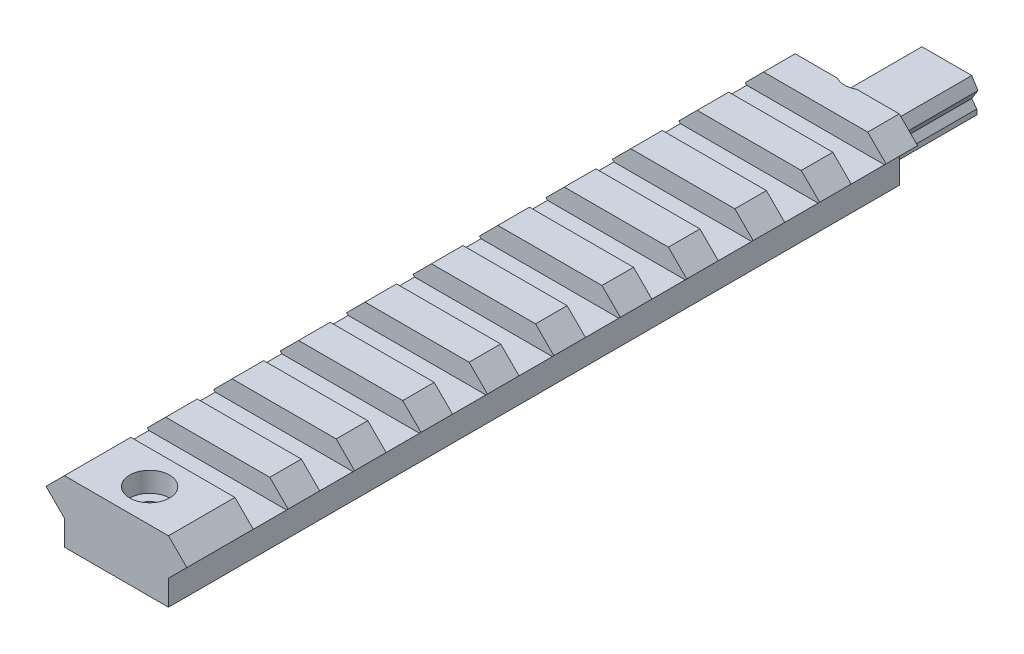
from build123d import *

# Parameters (mm, degrees)
EXTRUDE_1_DEPTH     = 110
SKETCH_3_W          = 21.2
SKETCH_3_H          = 5.25
CUT_EXTRUDE_1_DEPTH = 3
SKETCH_4_R          = 3
CUT_EXTRUDE_2_DEPTH = 3
SKETCH_5_R          = 1.5
CUT_EXTRUDE_3_DEPTH = 114.880982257
EXTRUDE_2_DEPTH     = 15
SKETCH_9_R          = 1
CUT_EXTRUDE_6_DEPTH = 5
SKETCH_10_R         = 3
CUT_EXTRUDE_7_DEPTH = 114.803395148
SKETCH_11_R         = 1.5
CUT_EXTRUDE_8_DEPTH = 114.803395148


with BuildPart() as part:
    # Sketch 2 → Extrude 1 (new body)
    with BuildSketch(Plane.XY):
        Polygon((-26.026243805, 24.439556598), (-26.026243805, 29.969556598), (-28.791243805, 27.204556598), align=None)
        Polygon((-10.356243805, 29.969556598), (-26.026243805, 29.969556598), (-26.026243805, 24.439556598), (-26.026243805, 20.649556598), (-10.356243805, 20.649556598), (-10.356243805, 24.439556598), align=None)
        Polygon((-7.591243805, 27.204556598), (-10.356243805, 29.969556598), (-10.356243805, 24.439556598), align=None)
    extrude(amount=EXTRUDE_1_DEPTH)

    # Sketch 3 → Cut-Extrude 1 (cut)
    with BuildSketch(Plane(origin=(0, 29.969556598, 0), x_dir=(1, 0, 0), z_dir=(0, 1, 0))):
        with Locations((-18.191243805, -7.375)):
            Rectangle(SKETCH_3_W, SKETCH_3_H)
        with Locations((-18.191243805, -17.375)):
            Rectangle(SKETCH_3_W, SKETCH_3_H)
        with Locations((-18.191243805, -27.375)):
            Rectangle(SKETCH_3_W, SKETCH_3_H)
        with Locations((-18.191243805, -37.375)):
            Rectangle(SKETCH_3_W, SKETCH_3_H)
        with Locations((-18.191243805, -47.375)):
            Rectangle(SKETCH_3_W, SKETCH_3_H)
        with Locations((-18.191243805, -57.375)):
            Rectangle(SKETCH_3_W, SKETCH_3_H)
        with Locations((-18.191243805, -67.375)):
            Rectangle(SKETCH_3_W, SKETCH_3_H)
        with Locations((-18.191243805, -77.375)):
            Rectangle(SKETCH_3_W, SKETCH_3_H)
        with Locations((-18.191243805, -87.375)):
            Rectangle(SKETCH_3_W, SKETCH_3_H)
        with Locations((-18.191243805, -97.375)):
            Rectangle(SKETCH_3_W, SKETCH_3_H)
    extrude(amount=-CUT_EXTRUDE_1_DEPTH, mode=Mode.SUBTRACT)

    # Sketch 4 → Cut-Extrude 2 (cut)
    with BuildSketch(Plane(origin=(0, 29.969556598, 0), x_dir=(1, 0, 0), z_dir=(0, 1, 0))):
        with Locations(Location((-18.191243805, -105, 0), (0, 0, 180))):
            Circle(SKETCH_4_R)
    extrude(amount=-CUT_EXTRUDE_2_DEPTH, mode=Mode.SUBTRACT)

    # Sketch 5 → Cut-Extrude 3 (cut, through all)
    with BuildSketch(Plane(origin=(0, 26.969556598, 0), x_dir=(1, 0, 0), z_dir=(0, 1, 0))):
        with Locations(Location((-18.191243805, -105, 0), (0, 0, 180))):
            Circle(SKETCH_5_R)
    extrude(amount=-CUT_EXTRUDE_3_DEPTH, mode=Mode.SUBTRACT)

    # Sketch 8 → Extrude 2 (add)
    with BuildSketch(Plane(origin=(0, 0, 0), x_dir=(-1, 0, 0), z_dir=(0, 0, -1))):
        Polygon((22.691243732, 20.647581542), (22.691243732, 21.425081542), (21.941538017, 22.42524977), (22.878224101, 23.92524977), (21.941243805, 25.425411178), (14.441243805, 25.428702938), (13.503899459, 23.929114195), (14.441538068, 22.426120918), (13.691585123, 21.429031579), (13.691243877, 20.651531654), align=None)
    extrude(amount=EXTRUDE_2_DEPTH)

    # Sketch 9 → Cut-Extrude 6 (cut)
    with BuildSketch(Plane(origin=(0, 0, 0), x_dir=(-1, 0, 0), z_dir=(0, 0, -1))):
        with Locations((12.356243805, 22.544556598)):
            Circle(SKETCH_9_R)
        with Locations((24.026243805, 22.544556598)):
            Circle(SKETCH_9_R)
    extrude(amount=-CUT_EXTRUDE_6_DEPTH, mode=Mode.SUBTRACT)

    # Sketch 10 → Cut-Extrude 7 (cut, through all)
    with BuildSketch(Plane(origin=(-0.011163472, 25.43503632, 0), x_dir=(0.9999999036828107, 0.0004389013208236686, 0), z_dir=(-0.0004389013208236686, 0.9999999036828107, 0))):
        with Locations((-18.180082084, 2.625)):
            Circle(SKETCH_10_R)
    extrude(amount=CUT_EXTRUDE_7_DEPTH, mode=Mode.SUBTRACT)

    # Sketch 11 → Cut-Extrude 8 (cut, through all)
    with BuildSketch(Plane(origin=(-0.011163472, 25.43503632, 0), x_dir=(0.9999999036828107, 0.0004389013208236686, 0), z_dir=(-0.0004389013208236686, 0.9999999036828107, 0))):
        with Locations(Location((-18.180082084, 2.625, 0), (0, 0, 180))):
            Circle(SKETCH_11_R)
    extrude(amount=-CUT_EXTRUDE_8_DEPTH, mode=Mode.SUBTRACT)


solid = part.part
